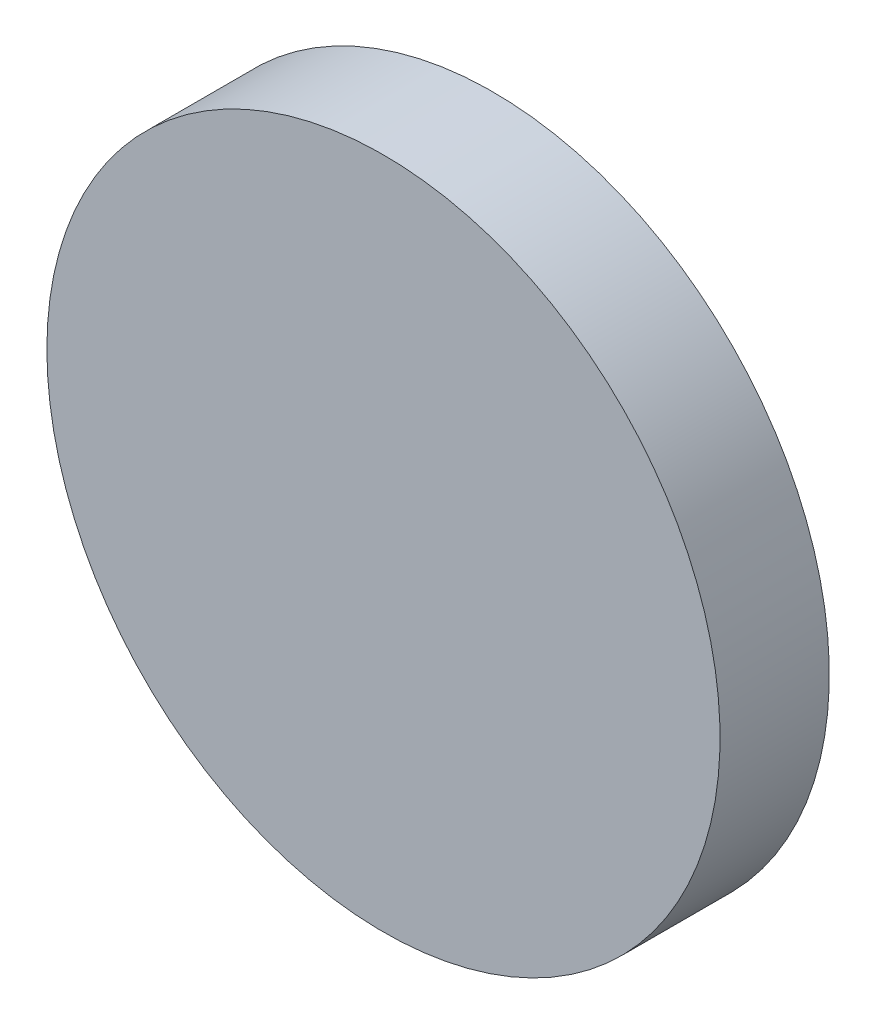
ISO-10303-21;
HEADER;
FILE_DESCRIPTION(('STEP AP214'),'2;1');
FILE_NAME('part.step','',(''),(''),'','','');
FILE_SCHEMA(('AUTOMOTIVE_DESIGN { 1 0 10303 214 1 1 1 1 }'));
ENDSEC;
DATA;
#1=APPLICATION_CONTEXT('core data for automotive mechanical design processes');
#2=APPLICATION_PROTOCOL_DEFINITION('international standard','automotive_design',2000,#1);
#3=PRODUCT_CONTEXT('',#1,'mechanical');
#4=PRODUCT('Part','Part','',(#3));
#5=PRODUCT_RELATED_PRODUCT_CATEGORY('part','',(#4));
#6=PRODUCT_DEFINITION_FORMATION('','',#4);
#7=PRODUCT_DEFINITION_CONTEXT('part definition',#1,'design');
#8=PRODUCT_DEFINITION('design','',#6,#7);
#9=PRODUCT_DEFINITION_SHAPE('','',#8);
#10=(LENGTH_UNIT() NAMED_UNIT(*) SI_UNIT(.MILLI.,.METRE.));
#11=(NAMED_UNIT(*) PLANE_ANGLE_UNIT() SI_UNIT($,.RADIAN.));
#12=(NAMED_UNIT(*) SI_UNIT($,.STERADIAN.) SOLID_ANGLE_UNIT());
#13=UNCERTAINTY_MEASURE_WITH_UNIT(LENGTH_MEASURE(1.E-05),#10,'distance_accuracy_value','');
#14=(GEOMETRIC_REPRESENTATION_CONTEXT(3) GLOBAL_UNCERTAINTY_ASSIGNED_CONTEXT((#13)) GLOBAL_UNIT_ASSIGNED_CONTEXT((#10,
#11,#12)) REPRESENTATION_CONTEXT('',''));
#15=CARTESIAN_POINT('',(0.,0.,0.));
#16=DIRECTION('',(0.,0.,1.));
#17=DIRECTION('',(1.,0.,0.));
#18=AXIS2_PLACEMENT_3D('',#15,#16,#17);
#19=CARTESIAN_POINT('',(650.,0.,-1118.));
#20=DIRECTION('',(0.,0.,-1.));
#21=DIRECTION('',(-1.,0.,0.));
#22=AXIS2_PLACEMENT_3D('',#19,#20,#21);
#23=PLANE('',#22);
#24=CARTESIAN_POINT('',(0.,0.,-1118.));
#25=DIRECTION('',(0.,0.,-1.));
#26=DIRECTION('',(-1.,0.,0.));
#27=AXIS2_PLACEMENT_3D('',#24,#25,#26);
#28=CIRCLE('',#27,650.);
#29=CARTESIAN_POINT('',(-650.,0.,-1118.));
#30=VERTEX_POINT('',#29);
#31=EDGE_CURVE('E24',#30,#30,#28,.T.);
#32=ORIENTED_EDGE('',*,*,#31,.F.);
#33=EDGE_LOOP('',(#32));
#34=FACE_BOUND('',#33,.T.);
#35=ADVANCED_FACE('F14',(#34),#23,.F.);
#36=CARTESIAN_POINT('',(0.,0.,-1518.));
#37=DIRECTION('',(0.,0.,1.));
#38=DIRECTION('',(1.,0.,0.));
#39=AXIS2_PLACEMENT_3D('',#36,#37,#38);
#40=PLANE('',#39);
#41=CARTESIAN_POINT('',(0.,0.,-1518.));
#42=DIRECTION('',(0.,0.,-1.));
#43=DIRECTION('',(-1.,0.,0.));
#44=AXIS2_PLACEMENT_3D('',#41,#42,#43);
#45=CIRCLE('',#44,380.);
#46=CARTESIAN_POINT('',(-380.,0.,-1518.));
#47=VERTEX_POINT('',#46);
#48=EDGE_CURVE('E9',#47,#47,#45,.T.);
#49=ORIENTED_EDGE('',*,*,#48,.T.);
#50=EDGE_LOOP('',(#49));
#51=FACE_BOUND('',#50,.T.);
#52=ADVANCED_FACE('F34',(#51),#40,.F.);
#53=CARTESIAN_POINT('',(0.,0.,-1329.));
#54=DIRECTION('',(0.,0.,1.));
#55=DIRECTION('',(1.,0.,0.));
#56=AXIS2_PLACEMENT_3D('',#53,#54,#55);
#57=CONICAL_SURFACE('',#56,650.,0.960070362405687);
#58=ORIENTED_EDGE('',*,*,#48,.F.);
#59=EDGE_LOOP('',(#58));
#60=FACE_BOUND('',#59,.T.);
#61=CARTESIAN_POINT('',(0.,0.,-1329.));
#62=DIRECTION('',(0.,0.,-1.));
#63=DIRECTION('',(-1.,0.,0.));
#64=AXIS2_PLACEMENT_3D('',#61,#62,#63);
#65=CIRCLE('',#64,650.);
#66=CARTESIAN_POINT('',(-650.,0.,-1329.));
#67=VERTEX_POINT('',#66);
#68=EDGE_CURVE('E20',#67,#67,#65,.T.);
#69=ORIENTED_EDGE('',*,*,#68,.T.);
#70=EDGE_LOOP('',(#69));
#71=FACE_BOUND('',#70,.T.);
#72=ADVANCED_FACE('F40',(#60,#71),#57,.T.);
#73=CARTESIAN_POINT('',(0.,0.,0.));
#74=DIRECTION('',(0.,0.,-1.));
#75=DIRECTION('',(-1.,0.,0.));
#76=AXIS2_PLACEMENT_3D('',#73,#74,#75);
#77=CYLINDRICAL_SURFACE('',#76,650.);
#78=ORIENTED_EDGE('',*,*,#68,.F.);
#79=EDGE_LOOP('',(#78));
#80=FACE_BOUND('',#79,.T.);
#81=ORIENTED_EDGE('',*,*,#31,.T.);
#82=EDGE_LOOP('',(#81));
#83=FACE_BOUND('',#82,.T.);
#84=ADVANCED_FACE('F31',(#80,#83),#77,.T.);
#85=CLOSED_SHELL('',(#35,#52,#72,#84));
#86=MANIFOLD_SOLID_BREP('B1',#85);
#87=ADVANCED_BREP_SHAPE_REPRESENTATION('',(#18,#86),#14);
#88=SHAPE_DEFINITION_REPRESENTATION(#9,#87);
ENDSEC;
END-ISO-10303-21;
